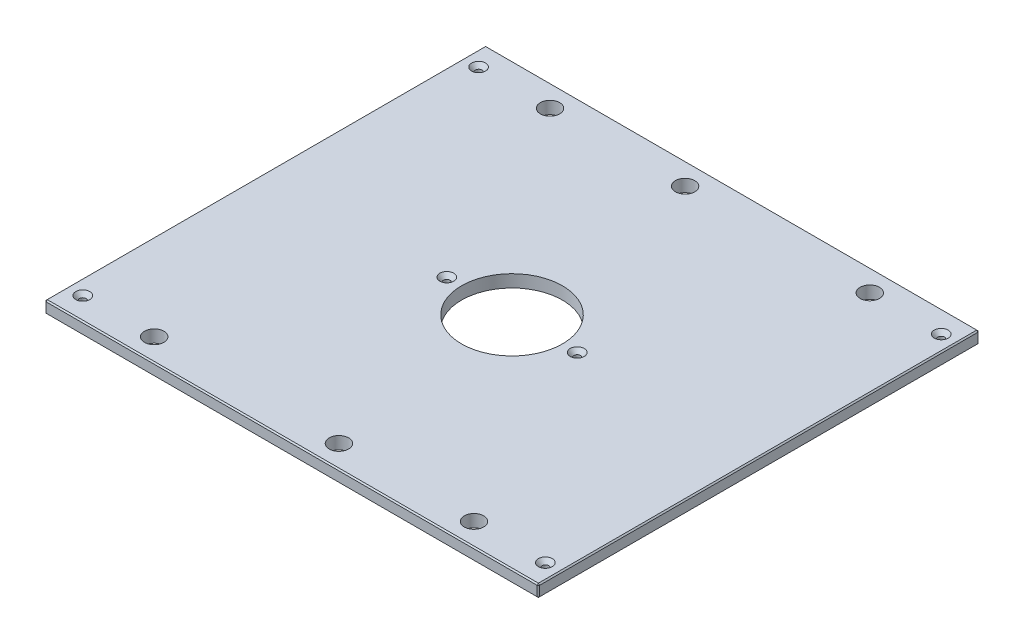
from build123d import *

# Parameters (mm, degrees)
SKETCH1_W                                        = 504.825
SKETCH1_H                                        = 450.85
BOSS_EXTRUDE1_DEPTH                              = 12.7
SKETCH13_R                                       = 51.562
CUT_EXTRUDE6_DEPTH                               = 339.658811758
F_25_32_0_78125_DIAMETER_HOLE1_D                 = 19.84375
CHAMFER2_SIZE                                    = 1.27
CSK_FOR_1_4_FLAT_HEAD_MACHINE_SCREW1_D           = 6.7564
CSK_FOR_1_4_FLAT_HEAD_MACHINE_SCREW1_CSINK_D     = 14.2748
CSK_FOR_1_4_FLAT_HEAD_MACHINE_SCREW1_CSINK_ANGLE = 82


with BuildPart() as part:
    # Sketch1 → Boss-Extrude1 (new body)
    with BuildSketch(Plane(origin=(0, 0, 0), x_dir=(1, 0, 0), z_dir=(0, 1, 0))):
        Rectangle(SKETCH1_W, SKETCH1_H)
    extrude(amount=BOSS_EXTRUDE1_DEPTH)

    # Sketch13 → Cut-Extrude6 (cut, through all)
    with BuildSketch(Plane(origin=(0, 12.7, 0), x_dir=(1, 0, 0), z_dir=(0, 1, 0))):
        with Locations(Location((0, 0, 0), (0, 0, 270))):
            Circle(SKETCH13_R)
    extrude(amount=-CUT_EXTRUDE6_DEPTH, mode=Mode.SUBTRACT)

    # 25_32 _0.78125_ Diameter Hole1 (through all)
    with Locations(Plane(origin=(0, 12.7, 0), x_dir=(1, 0, 0), z_dir=(0, 1, 0))):
        with Locations((163.5125, 202.40498), (-163.5125, 202.40498), (163.5125, -202.40498), (-163.5125, -202.40498), (-25.4, 202.40498), (25.4, -202.40498)):
            Hole(F_25_32_0_78125_DIAMETER_HOLE1_D / 2)

    # Chamfer2
    chamfer2_edges = [part.edges().sort_by_distance(p)[0] for p in [
        (252.4125, 12.7, 0),
        (0, 12.7, -225.425),
        (-252.4125, 12.7, 0),
        (0, 0, -225.425),
        (252.4125, 0, 0),
        (0, 0, 225.425),
        (-252.4125, 0, 0),
        (0, 12.7, 225.425),
        (-252.4125, 6.35, -225.425),
        (252.4125, 6.35, -225.425),
        (252.4125, 6.35, 225.425),
        (-252.4125, 6.35, 225.425),
    ]]
    chamfer(chamfer2_edges, length=CHAMFER2_SIZE)

    # CSK for 1_4 Flat Head Machine Screw1 (through all)
    with Locations(Plane(origin=(0, 12.7, 0), x_dir=(1, 0, 0), z_dir=(0, 1, 0))):
        with Locations((236.5375, 202.40498), (236.5375, -202.40498), (-236.5375, -202.40498), (-66.675, 0), (66.675, 0), (-236.5375, 202.40498), (-163.5125, 202.40498), (-163.5125, -202.40498)):
            CounterSinkHole(CSK_FOR_1_4_FLAT_HEAD_MACHINE_SCREW1_D / 2, CSK_FOR_1_4_FLAT_HEAD_MACHINE_SCREW1_CSINK_D / 2, counter_sink_angle=CSK_FOR_1_4_FLAT_HEAD_MACHINE_SCREW1_CSINK_ANGLE)


solid = part.part
